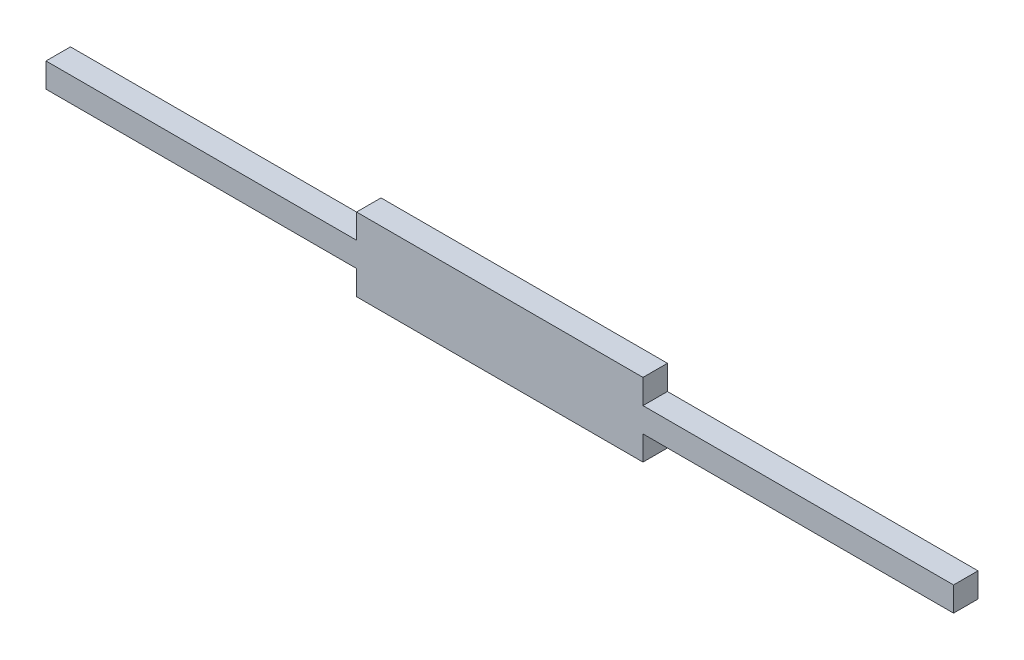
from build123d import *

# Parameters (mm, degrees)
BOSS_EXTRUDE1_DEPTH = 1.524


with BuildPart() as part:
    # Sketch1 → Boss-Extrude1 (new body)
    with BuildSketch(Plane.XY):
        Polygon((-38.059027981, -1.524), (-38.059027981, 0), (-20.213468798, 0), (-20.213468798, -1.524), (-0.866751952, -1.524), (-0.866751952, -3.048), (-20.213468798, -3.048), (-20.213468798, -4.572), (-38.059027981, -4.572), (-38.059027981, -3.048), (-57.405744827, -3.048), (-57.405744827, -1.524), align=None)
    extrude(amount=BOSS_EXTRUDE1_DEPTH)


solid = part.part
